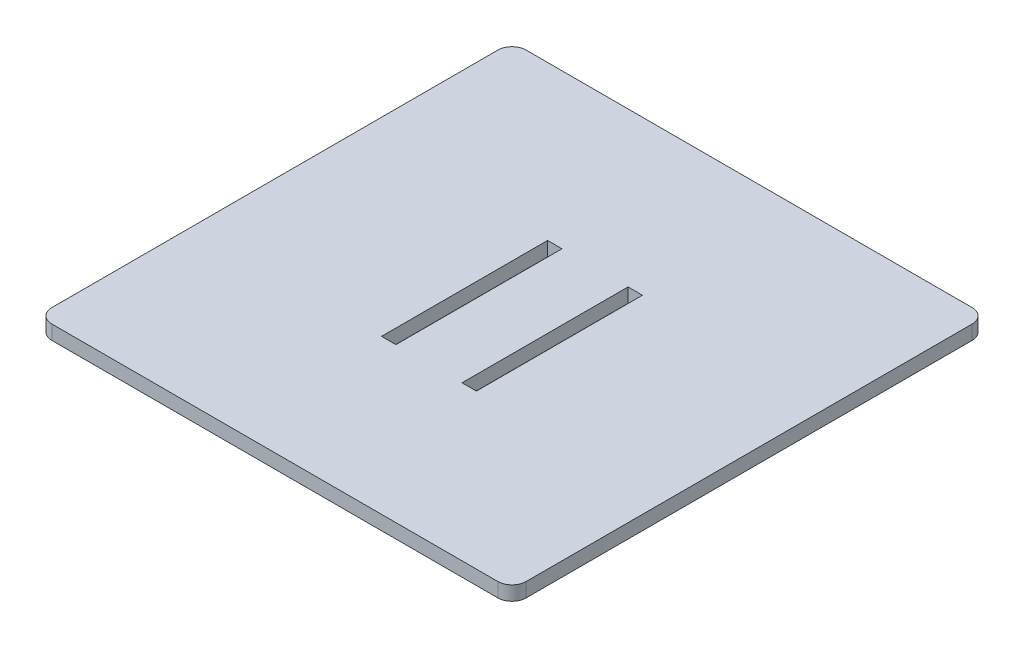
ISO-10303-21;
HEADER;
FILE_DESCRIPTION(('STEP AP214'),'2;1');
FILE_NAME('part.step','',(''),(''),'','','');
FILE_SCHEMA(('AUTOMOTIVE_DESIGN { 1 0 10303 214 1 1 1 1 }'));
ENDSEC;
DATA;
#1=APPLICATION_CONTEXT('core data for automotive mechanical design processes');
#2=APPLICATION_PROTOCOL_DEFINITION('international standard','automotive_design',2000,#1);
#3=PRODUCT_CONTEXT('',#1,'mechanical');
#4=PRODUCT('Part','Part','',(#3));
#5=PRODUCT_RELATED_PRODUCT_CATEGORY('part','',(#4));
#6=PRODUCT_DEFINITION_FORMATION('','',#4);
#7=PRODUCT_DEFINITION_CONTEXT('part definition',#1,'design');
#8=PRODUCT_DEFINITION('design','',#6,#7);
#9=PRODUCT_DEFINITION_SHAPE('','',#8);
#10=(LENGTH_UNIT() NAMED_UNIT(*) SI_UNIT(.MILLI.,.METRE.));
#11=(NAMED_UNIT(*) PLANE_ANGLE_UNIT() SI_UNIT($,.RADIAN.));
#12=(NAMED_UNIT(*) SI_UNIT($,.STERADIAN.) SOLID_ANGLE_UNIT());
#13=UNCERTAINTY_MEASURE_WITH_UNIT(LENGTH_MEASURE(1.E-05),#10,'distance_accuracy_value','');
#14=(GEOMETRIC_REPRESENTATION_CONTEXT(3) GLOBAL_UNCERTAINTY_ASSIGNED_CONTEXT((#13)) GLOBAL_UNIT_ASSIGNED_CONTEXT((#10,
#11,#12)) REPRESENTATION_CONTEXT('',''));
#15=CARTESIAN_POINT('',(0.,0.,0.));
#16=DIRECTION('',(0.,0.,1.));
#17=DIRECTION('',(1.,0.,0.));
#18=AXIS2_PLACEMENT_3D('',#15,#16,#17);
#19=CARTESIAN_POINT('',(0.,6.,0.));
#20=DIRECTION('',(0.,1.,0.));
#21=DIRECTION('',(0.,0.,1.));
#22=AXIS2_PLACEMENT_3D('',#19,#20,#21);
#23=PLANE('',#22);
#24=DIRECTION('',(0.,0.,-1.));
#25=VECTOR('',#24,1.);
#26=CARTESIAN_POINT('',(100.,6.,-100.));
#27=LINE('',#26,#25);
#28=CARTESIAN_POINT('',(100.,6.,94.));
#29=VERTEX_POINT('',#28);
#30=CARTESIAN_POINT('',(100.,6.,-94.));
#31=VERTEX_POINT('',#30);
#32=EDGE_CURVE('E259',#29,#31,#27,.T.);
#33=ORIENTED_EDGE('',*,*,#32,.T.);
#34=CARTESIAN_POINT('',(94.,6.,-94.));
#35=DIRECTION('',(0.,1.,0.));
#36=DIRECTION('',(0.,0.,1.));
#37=AXIS2_PLACEMENT_3D('',#34,#35,#36);
#38=CIRCLE('',#37,6.);
#39=CARTESIAN_POINT('',(94.,6.,-100.));
#40=VERTEX_POINT('',#39);
#41=EDGE_CURVE('E321',#31,#40,#38,.T.);
#42=ORIENTED_EDGE('',*,*,#41,.T.);
#43=DIRECTION('',(-1.,0.,0.));
#44=VECTOR('',#43,1.);
#45=CARTESIAN_POINT('',(-100.,6.,-100.));
#46=LINE('',#45,#44);
#47=CARTESIAN_POINT('',(-94.,6.,-100.));
#48=VERTEX_POINT('',#47);
#49=EDGE_CURVE('E263',#40,#48,#46,.T.);
#50=ORIENTED_EDGE('',*,*,#49,.T.);
#51=CARTESIAN_POINT('',(-94.,6.,-94.));
#52=DIRECTION('',(0.,1.,0.));
#53=DIRECTION('',(0.,0.,1.));
#54=AXIS2_PLACEMENT_3D('',#51,#52,#53);
#55=CIRCLE('',#54,6.);
#56=CARTESIAN_POINT('',(-100.,6.,-94.));
#57=VERTEX_POINT('',#56);
#58=EDGE_CURVE('E318',#48,#57,#55,.T.);
#59=ORIENTED_EDGE('',*,*,#58,.T.);
#60=DIRECTION('',(0.,0.,1.));
#61=VECTOR('',#60,1.);
#62=CARTESIAN_POINT('',(-100.,6.,-100.));
#63=LINE('',#62,#61);
#64=CARTESIAN_POINT('',(-100.,6.,94.));
#65=VERTEX_POINT('',#64);
#66=EDGE_CURVE('E268',#57,#65,#63,.T.);
#67=ORIENTED_EDGE('',*,*,#66,.T.);
#68=CARTESIAN_POINT('',(-94.,6.,94.));
#69=DIRECTION('',(0.,1.,0.));
#70=DIRECTION('',(0.,0.,1.));
#71=AXIS2_PLACEMENT_3D('',#68,#69,#70);
#72=CIRCLE('',#71,6.);
#73=CARTESIAN_POINT('',(-94.,6.,100.));
#74=VERTEX_POINT('',#73);
#75=EDGE_CURVE('E69',#65,#74,#72,.T.);
#76=ORIENTED_EDGE('',*,*,#75,.T.);
#77=DIRECTION('',(1.,0.,0.));
#78=VECTOR('',#77,1.);
#79=CARTESIAN_POINT('',(-100.,6.,100.));
#80=LINE('',#79,#78);
#81=CARTESIAN_POINT('',(94.,6.,100.));
#82=VERTEX_POINT('',#81);
#83=EDGE_CURVE('E271',#74,#82,#80,.T.);
#84=ORIENTED_EDGE('',*,*,#83,.T.);
#85=CARTESIAN_POINT('',(94.,6.,94.));
#86=DIRECTION('',(0.,1.,0.));
#87=DIRECTION('',(0.,0.,1.));
#88=AXIS2_PLACEMENT_3D('',#85,#86,#87);
#89=CIRCLE('',#88,6.);
#90=EDGE_CURVE('E313',#82,#29,#89,.T.);
#91=ORIENTED_EDGE('',*,*,#90,.T.);
#92=EDGE_LOOP('',(#33,#42,#50,#59,#67,#76,#84,#91));
#93=FACE_BOUND('',#92,.T.);
#94=DIRECTION('',(1.,0.,0.));
#95=VECTOR('',#94,1.);
#96=CARTESIAN_POINT('',(-20.,6.,35.));
#97=LINE('',#96,#95);
#98=CARTESIAN_POINT('',(-20.,6.,35.));
#99=VERTEX_POINT('',#98);
#100=CARTESIAN_POINT('',(-13.93,6.,35.));
#101=VERTEX_POINT('',#100);
#102=EDGE_CURVE('E219',#99,#101,#97,.T.);
#103=ORIENTED_EDGE('',*,*,#102,.F.);
#104=DIRECTION('',(0.,0.,1.));
#105=VECTOR('',#104,1.);
#106=CARTESIAN_POINT('',(-20.,6.,-35.));
#107=LINE('',#106,#105);
#108=CARTESIAN_POINT('',(-20.,6.,-35.));
#109=VERTEX_POINT('',#108);
#110=EDGE_CURVE('E216',#109,#99,#107,.T.);
#111=ORIENTED_EDGE('',*,*,#110,.F.);
#112=DIRECTION('',(-1.,0.,0.));
#113=VECTOR('',#112,1.);
#114=CARTESIAN_POINT('',(-20.,6.,-35.));
#115=LINE('',#114,#113);
#116=CARTESIAN_POINT('',(-13.93,6.,-35.));
#117=VERTEX_POINT('',#116);
#118=EDGE_CURVE('E227',#117,#109,#115,.T.);
#119=ORIENTED_EDGE('',*,*,#118,.F.);
#120=DIRECTION('',(0.,0.,-1.));
#121=VECTOR('',#120,1.);
#122=CARTESIAN_POINT('',(-13.93,6.,-35.));
#123=LINE('',#122,#121);
#124=EDGE_CURVE('E223',#101,#117,#123,.T.);
#125=ORIENTED_EDGE('',*,*,#124,.F.);
#126=EDGE_LOOP('',(#103,#111,#119,#125));
#127=FACE_BOUND('',#126,.T.);
#128=DIRECTION('',(-1.,0.,0.));
#129=VECTOR('',#128,1.);
#130=CARTESIAN_POINT('',(20.,6.,-34.9999999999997));
#131=LINE('',#130,#129);
#132=CARTESIAN_POINT('',(20.,6.,-34.9999999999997));
#133=VERTEX_POINT('',#132);
#134=CARTESIAN_POINT('',(13.93,6.,-34.9999999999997));
#135=VERTEX_POINT('',#134);
#136=EDGE_CURVE('E174',#133,#135,#131,.T.);
#137=ORIENTED_EDGE('',*,*,#136,.F.);
#138=DIRECTION('',(0.,0.,-1.));
#139=VECTOR('',#138,1.);
#140=CARTESIAN_POINT('',(20.,6.,35.));
#141=LINE('',#140,#139);
#142=CARTESIAN_POINT('',(20.,6.,35.));
#143=VERTEX_POINT('',#142);
#144=EDGE_CURVE('E163',#143,#133,#141,.T.);
#145=ORIENTED_EDGE('',*,*,#144,.F.);
#146=DIRECTION('',(1.,0.,0.));
#147=VECTOR('',#146,1.);
#148=CARTESIAN_POINT('',(20.,6.,35.));
#149=LINE('',#148,#147);
#150=CARTESIAN_POINT('',(13.93,6.,35.));
#151=VERTEX_POINT('',#150);
#152=EDGE_CURVE('E192',#151,#143,#149,.T.);
#153=ORIENTED_EDGE('',*,*,#152,.F.);
#154=DIRECTION('',(0.,0.,1.));
#155=VECTOR('',#154,1.);
#156=CARTESIAN_POINT('',(13.93,6.,35.));
#157=LINE('',#156,#155);
#158=EDGE_CURVE('E188',#135,#151,#157,.T.);
#159=ORIENTED_EDGE('',*,*,#158,.F.);
#160=EDGE_LOOP('',(#137,#145,#153,#159));
#161=FACE_BOUND('',#160,.T.);
#162=ADVANCED_FACE('F47',(#93,#127,#161),#23,.T.);
#163=CARTESIAN_POINT('',(0.,0.,0.));
#164=DIRECTION('',(0.,1.,0.));
#165=DIRECTION('',(0.,0.,1.));
#166=AXIS2_PLACEMENT_3D('',#163,#164,#165);
#167=PLANE('',#166);
#168=DIRECTION('',(0.,0.,1.));
#169=VECTOR('',#168,1.);
#170=CARTESIAN_POINT('',(-20.,0.,-35.));
#171=LINE('',#170,#169);
#172=CARTESIAN_POINT('',(-20.,0.,-35.));
#173=VERTEX_POINT('',#172);
#174=CARTESIAN_POINT('',(-20.,0.,35.));
#175=VERTEX_POINT('',#174);
#176=EDGE_CURVE('E183',#173,#175,#171,.T.);
#177=ORIENTED_EDGE('',*,*,#176,.T.);
#178=DIRECTION('',(1.,0.,0.));
#179=VECTOR('',#178,1.);
#180=CARTESIAN_POINT('',(-20.,0.,35.));
#181=LINE('',#180,#179);
#182=CARTESIAN_POINT('',(-13.93,0.,35.));
#183=VERTEX_POINT('',#182);
#184=EDGE_CURVE('E234',#175,#183,#181,.T.);
#185=ORIENTED_EDGE('',*,*,#184,.T.);
#186=DIRECTION('',(0.,0.,-1.));
#187=VECTOR('',#186,1.);
#188=CARTESIAN_POINT('',(-13.93,0.,-35.));
#189=LINE('',#188,#187);
#190=CARTESIAN_POINT('',(-13.93,0.,-35.));
#191=VERTEX_POINT('',#190);
#192=EDGE_CURVE('E238',#183,#191,#189,.T.);
#193=ORIENTED_EDGE('',*,*,#192,.T.);
#194=DIRECTION('',(-1.,0.,0.));
#195=VECTOR('',#194,1.);
#196=CARTESIAN_POINT('',(-20.,0.,-35.));
#197=LINE('',#196,#195);
#198=EDGE_CURVE('E220',#191,#173,#197,.T.);
#199=ORIENTED_EDGE('',*,*,#198,.T.);
#200=EDGE_LOOP('',(#177,#185,#193,#199));
#201=FACE_BOUND('',#200,.T.);
#202=DIRECTION('',(-1.,0.,0.));
#203=VECTOR('',#202,1.);
#204=CARTESIAN_POINT('',(-100.,0.,-100.));
#205=LINE('',#204,#203);
#206=CARTESIAN_POINT('',(94.,0.,-100.));
#207=VERTEX_POINT('',#206);
#208=CARTESIAN_POINT('',(-94.,0.,-100.));
#209=VERTEX_POINT('',#208);
#210=EDGE_CURVE('E278',#207,#209,#205,.T.);
#211=ORIENTED_EDGE('',*,*,#210,.F.);
#212=CARTESIAN_POINT('',(94.,0.,-94.));
#213=DIRECTION('',(0.,1.,0.));
#214=DIRECTION('',(0.,0.,1.));
#215=AXIS2_PLACEMENT_3D('',#212,#213,#214);
#216=CIRCLE('',#215,6.);
#217=CARTESIAN_POINT('',(100.,0.,-94.));
#218=VERTEX_POINT('',#217);
#219=EDGE_CURVE('E303',#207,#218,#216,.F.);
#220=ORIENTED_EDGE('',*,*,#219,.T.);
#221=DIRECTION('',(0.,0.,-1.));
#222=VECTOR('',#221,1.);
#223=CARTESIAN_POINT('',(100.,0.,-100.));
#224=LINE('',#223,#222);
#225=CARTESIAN_POINT('',(100.,0.,94.));
#226=VERTEX_POINT('',#225);
#227=EDGE_CURVE('E258',#226,#218,#224,.T.);
#228=ORIENTED_EDGE('',*,*,#227,.F.);
#229=CARTESIAN_POINT('',(94.,0.,94.));
#230=DIRECTION('',(0.,1.,0.));
#231=DIRECTION('',(0.,0.,1.));
#232=AXIS2_PLACEMENT_3D('',#229,#230,#231);
#233=CIRCLE('',#232,6.);
#234=CARTESIAN_POINT('',(94.,0.,100.));
#235=VERTEX_POINT('',#234);
#236=EDGE_CURVE('E294',#226,#235,#233,.F.);
#237=ORIENTED_EDGE('',*,*,#236,.T.);
#238=DIRECTION('',(1.,0.,0.));
#239=VECTOR('',#238,1.);
#240=CARTESIAN_POINT('',(-100.,0.,100.));
#241=LINE('',#240,#239);
#242=CARTESIAN_POINT('',(-94.,0.,100.));
#243=VERTEX_POINT('',#242);
#244=EDGE_CURVE('E264',#243,#235,#241,.T.);
#245=ORIENTED_EDGE('',*,*,#244,.F.);
#246=CARTESIAN_POINT('',(-94.,0.,94.));
#247=DIRECTION('',(0.,1.,0.));
#248=DIRECTION('',(0.,0.,1.));
#249=AXIS2_PLACEMENT_3D('',#246,#247,#248);
#250=CIRCLE('',#249,6.);
#251=CARTESIAN_POINT('',(-100.,0.,94.));
#252=VERTEX_POINT('',#251);
#253=EDGE_CURVE('E297',#243,#252,#250,.F.);
#254=ORIENTED_EDGE('',*,*,#253,.T.);
#255=DIRECTION('',(0.,0.,1.));
#256=VECTOR('',#255,1.);
#257=CARTESIAN_POINT('',(-100.,0.,-100.));
#258=LINE('',#257,#256);
#259=CARTESIAN_POINT('',(-100.,0.,-94.));
#260=VERTEX_POINT('',#259);
#261=EDGE_CURVE('E282',#260,#252,#258,.T.);
#262=ORIENTED_EDGE('',*,*,#261,.F.);
#263=CARTESIAN_POINT('',(-94.,0.,-94.));
#264=DIRECTION('',(0.,1.,0.));
#265=DIRECTION('',(0.,0.,1.));
#266=AXIS2_PLACEMENT_3D('',#263,#264,#265);
#267=CIRCLE('',#266,6.);
#268=EDGE_CURVE('E300',#260,#209,#267,.F.);
#269=ORIENTED_EDGE('',*,*,#268,.T.);
#270=EDGE_LOOP('',(#211,#220,#228,#237,#245,#254,#262,#269));
#271=FACE_BOUND('',#270,.T.);
#272=DIRECTION('',(0.,0.,-1.));
#273=VECTOR('',#272,1.);
#274=CARTESIAN_POINT('',(20.,0.,35.));
#275=LINE('',#274,#273);
#276=CARTESIAN_POINT('',(20.,0.,35.));
#277=VERTEX_POINT('',#276);
#278=CARTESIAN_POINT('',(20.,0.,-34.9999999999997));
#279=VERTEX_POINT('',#278);
#280=EDGE_CURVE('E197',#277,#279,#275,.T.);
#281=ORIENTED_EDGE('',*,*,#280,.T.);
#282=DIRECTION('',(-1.,0.,0.));
#283=VECTOR('',#282,1.);
#284=CARTESIAN_POINT('',(20.,0.,-34.9999999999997));
#285=LINE('',#284,#283);
#286=CARTESIAN_POINT('',(13.93,0.,-34.9999999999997));
#287=VERTEX_POINT('',#286);
#288=EDGE_CURVE('E181',#279,#287,#285,.T.);
#289=ORIENTED_EDGE('',*,*,#288,.T.);
#290=DIRECTION('',(0.,0.,1.));
#291=VECTOR('',#290,1.);
#292=CARTESIAN_POINT('',(13.93,0.,35.));
#293=LINE('',#292,#291);
#294=CARTESIAN_POINT('',(13.93,0.,35.));
#295=VERTEX_POINT('',#294);
#296=EDGE_CURVE('E202',#287,#295,#293,.T.);
#297=ORIENTED_EDGE('',*,*,#296,.T.);
#298=DIRECTION('',(1.,0.,0.));
#299=VECTOR('',#298,1.);
#300=CARTESIAN_POINT('',(20.,0.,35.));
#301=LINE('',#300,#299);
#302=EDGE_CURVE('E175',#295,#277,#301,.T.);
#303=ORIENTED_EDGE('',*,*,#302,.T.);
#304=EDGE_LOOP('',(#281,#289,#297,#303));
#305=FACE_BOUND('',#304,.T.);
#306=ADVANCED_FACE('F341',(#201,#271,#305),#167,.F.);
#307=CARTESIAN_POINT('',(100.,6.,-100.));
#308=DIRECTION('',(-1.,0.,0.));
#309=DIRECTION('',(0.,0.,1.));
#310=AXIS2_PLACEMENT_3D('',#307,#308,#309);
#311=PLANE('',#310);
#312=ORIENTED_EDGE('',*,*,#227,.T.);
#313=DIRECTION('',(0.,-1.,0.));
#314=VECTOR('',#313,1.);
#315=CARTESIAN_POINT('',(100.,6.,-94.));
#316=LINE('',#315,#314);
#317=EDGE_CURVE('E310',#218,#31,#316,.F.);
#318=ORIENTED_EDGE('',*,*,#317,.T.);
#319=ORIENTED_EDGE('',*,*,#32,.F.);
#320=DIRECTION('',(0.,-1.,0.));
#321=VECTOR('',#320,1.);
#322=CARTESIAN_POINT('',(100.,6.,94.));
#323=LINE('',#322,#321);
#324=EDGE_CURVE('E306',#29,#226,#323,.T.);
#325=ORIENTED_EDGE('',*,*,#324,.T.);
#326=EDGE_LOOP('',(#312,#318,#319,#325));
#327=FACE_BOUND('',#326,.T.);
#328=ADVANCED_FACE('F355',(#327),#311,.F.);
#329=CARTESIAN_POINT('',(-100.,6.,-100.));
#330=DIRECTION('',(0.,0.,1.));
#331=DIRECTION('',(1.,0.,0.));
#332=AXIS2_PLACEMENT_3D('',#329,#330,#331);
#333=PLANE('',#332);
#334=ORIENTED_EDGE('',*,*,#49,.F.);
#335=DIRECTION('',(0.,-1.,0.));
#336=VECTOR('',#335,1.);
#337=CARTESIAN_POINT('',(94.,6.,-100.));
#338=LINE('',#337,#336);
#339=EDGE_CURVE('E290',#40,#207,#338,.T.);
#340=ORIENTED_EDGE('',*,*,#339,.T.);
#341=ORIENTED_EDGE('',*,*,#210,.T.);
#342=DIRECTION('',(0.,-1.,0.));
#343=VECTOR('',#342,1.);
#344=CARTESIAN_POINT('',(-94.,6.,-100.));
#345=LINE('',#344,#343);
#346=EDGE_CURVE('E274',#209,#48,#345,.F.);
#347=ORIENTED_EDGE('',*,*,#346,.T.);
#348=EDGE_LOOP('',(#334,#340,#341,#347));
#349=FACE_BOUND('',#348,.T.);
#350=ADVANCED_FACE('F363',(#349),#333,.F.);
#351=CARTESIAN_POINT('',(-100.,6.,-100.));
#352=DIRECTION('',(1.,0.,0.));
#353=DIRECTION('',(0.,0.,-1.));
#354=AXIS2_PLACEMENT_3D('',#351,#352,#353);
#355=PLANE('',#354);
#356=ORIENTED_EDGE('',*,*,#66,.F.);
#357=DIRECTION('',(0.,-1.,0.));
#358=VECTOR('',#357,1.);
#359=CARTESIAN_POINT('',(-100.,6.,-94.));
#360=LINE('',#359,#358);
#361=EDGE_CURVE('E327',#57,#260,#360,.T.);
#362=ORIENTED_EDGE('',*,*,#361,.T.);
#363=ORIENTED_EDGE('',*,*,#261,.T.);
#364=DIRECTION('',(0.,-1.,0.));
#365=VECTOR('',#364,1.);
#366=CARTESIAN_POINT('',(-100.,6.,94.));
#367=LINE('',#366,#365);
#368=EDGE_CURVE('E324',#252,#65,#367,.F.);
#369=ORIENTED_EDGE('',*,*,#368,.T.);
#370=EDGE_LOOP('',(#356,#362,#363,#369));
#371=FACE_BOUND('',#370,.T.);
#372=ADVANCED_FACE('F335',(#371),#355,.F.);
#373=CARTESIAN_POINT('',(-100.,6.,100.));
#374=DIRECTION('',(0.,0.,-1.));
#375=DIRECTION('',(-1.,0.,0.));
#376=AXIS2_PLACEMENT_3D('',#373,#374,#375);
#377=PLANE('',#376);
#378=ORIENTED_EDGE('',*,*,#83,.F.);
#379=DIRECTION('',(0.,-1.,0.));
#380=VECTOR('',#379,1.);
#381=CARTESIAN_POINT('',(-94.,6.,100.));
#382=LINE('',#381,#380);
#383=EDGE_CURVE('E11',#74,#243,#382,.T.);
#384=ORIENTED_EDGE('',*,*,#383,.T.);
#385=ORIENTED_EDGE('',*,*,#244,.T.);
#386=DIRECTION('',(0.,-1.,0.));
#387=VECTOR('',#386,1.);
#388=CARTESIAN_POINT('',(94.,6.,100.));
#389=LINE('',#388,#387);
#390=EDGE_CURVE('E56',#235,#82,#389,.F.);
#391=ORIENTED_EDGE('',*,*,#390,.T.);
#392=EDGE_LOOP('',(#378,#384,#385,#391));
#393=FACE_BOUND('',#392,.T.);
#394=ADVANCED_FACE('F347',(#393),#377,.F.);
#395=CARTESIAN_POINT('',(-20.,6.,-35.));
#396=DIRECTION('',(1.,0.,0.));
#397=DIRECTION('',(0.,0.,-1.));
#398=AXIS2_PLACEMENT_3D('',#395,#396,#397);
#399=PLANE('',#398);
#400=ORIENTED_EDGE('',*,*,#176,.F.);
#401=DIRECTION('',(0.,-1.,0.));
#402=VECTOR('',#401,1.);
#403=CARTESIAN_POINT('',(-20.,6.,-35.));
#404=LINE('',#403,#402);
#405=EDGE_CURVE('E230',#109,#173,#404,.T.);
#406=ORIENTED_EDGE('',*,*,#405,.F.);
#407=ORIENTED_EDGE('',*,*,#110,.T.);
#408=DIRECTION('',(0.,-1.,0.));
#409=VECTOR('',#408,1.);
#410=CARTESIAN_POINT('',(-20.,6.,35.));
#411=LINE('',#410,#409);
#412=EDGE_CURVE('E254',#99,#175,#411,.T.);
#413=ORIENTED_EDGE('',*,*,#412,.T.);
#414=EDGE_LOOP('',(#400,#406,#407,#413));
#415=FACE_BOUND('',#414,.T.);
#416=ADVANCED_FACE('F381',(#415),#399,.T.);
#417=CARTESIAN_POINT('',(-20.,6.,35.));
#418=DIRECTION('',(0.,0.,-1.));
#419=DIRECTION('',(-1.,0.,0.));
#420=AXIS2_PLACEMENT_3D('',#417,#418,#419);
#421=PLANE('',#420);
#422=ORIENTED_EDGE('',*,*,#184,.F.);
#423=ORIENTED_EDGE('',*,*,#412,.F.);
#424=ORIENTED_EDGE('',*,*,#102,.T.);
#425=DIRECTION('',(0.,-1.,0.));
#426=VECTOR('',#425,1.);
#427=CARTESIAN_POINT('',(-13.93,6.,35.));
#428=LINE('',#427,#426);
#429=EDGE_CURVE('E251',#101,#183,#428,.T.);
#430=ORIENTED_EDGE('',*,*,#429,.T.);
#431=EDGE_LOOP('',(#422,#423,#424,#430));
#432=FACE_BOUND('',#431,.T.);
#433=ADVANCED_FACE('F458',(#432),#421,.T.);
#434=CARTESIAN_POINT('',(-13.93,6.,-35.));
#435=DIRECTION('',(-1.,0.,0.));
#436=DIRECTION('',(0.,0.,1.));
#437=AXIS2_PLACEMENT_3D('',#434,#435,#436);
#438=PLANE('',#437);
#439=ORIENTED_EDGE('',*,*,#192,.F.);
#440=ORIENTED_EDGE('',*,*,#429,.F.);
#441=ORIENTED_EDGE('',*,*,#124,.T.);
#442=DIRECTION('',(0.,-1.,0.));
#443=VECTOR('',#442,1.);
#444=CARTESIAN_POINT('',(-13.93,6.,-35.));
#445=LINE('',#444,#443);
#446=EDGE_CURVE('E248',#117,#191,#445,.T.);
#447=ORIENTED_EDGE('',*,*,#446,.T.);
#448=EDGE_LOOP('',(#439,#440,#441,#447));
#449=FACE_BOUND('',#448,.T.);
#450=ADVANCED_FACE('F448',(#449),#438,.T.);
#451=CARTESIAN_POINT('',(-20.,6.,-35.));
#452=DIRECTION('',(0.,0.,1.));
#453=DIRECTION('',(1.,0.,0.));
#454=AXIS2_PLACEMENT_3D('',#451,#452,#453);
#455=PLANE('',#454);
#456=ORIENTED_EDGE('',*,*,#198,.F.);
#457=ORIENTED_EDGE('',*,*,#446,.F.);
#458=ORIENTED_EDGE('',*,*,#118,.T.);
#459=ORIENTED_EDGE('',*,*,#405,.T.);
#460=EDGE_LOOP('',(#456,#457,#458,#459));
#461=FACE_BOUND('',#460,.T.);
#462=ADVANCED_FACE('F439',(#461),#455,.T.);
#463=CARTESIAN_POINT('',(20.,6.,35.));
#464=DIRECTION('',(-1.,0.,0.));
#465=DIRECTION('',(0.,0.,1.));
#466=AXIS2_PLACEMENT_3D('',#463,#464,#465);
#467=PLANE('',#466);
#468=ORIENTED_EDGE('',*,*,#280,.F.);
#469=DIRECTION('',(0.,-1.,0.));
#470=VECTOR('',#469,1.);
#471=CARTESIAN_POINT('',(20.,6.,35.));
#472=LINE('',#471,#470);
#473=EDGE_CURVE('E169',#143,#277,#472,.T.);
#474=ORIENTED_EDGE('',*,*,#473,.F.);
#475=ORIENTED_EDGE('',*,*,#144,.T.);
#476=DIRECTION('',(0.,-1.,0.));
#477=VECTOR('',#476,1.);
#478=CARTESIAN_POINT('',(20.,6.,-34.9999999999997));
#479=LINE('',#478,#477);
#480=EDGE_CURVE('E166',#133,#279,#479,.T.);
#481=ORIENTED_EDGE('',*,*,#480,.T.);
#482=EDGE_LOOP('',(#468,#474,#475,#481));
#483=FACE_BOUND('',#482,.T.);
#484=ADVANCED_FACE('F165',(#483),#467,.T.);
#485=CARTESIAN_POINT('',(20.,6.,-34.9999999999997));
#486=DIRECTION('',(0.,0.,1.));
#487=DIRECTION('',(1.,0.,0.));
#488=AXIS2_PLACEMENT_3D('',#485,#486,#487);
#489=PLANE('',#488);
#490=ORIENTED_EDGE('',*,*,#288,.F.);
#491=ORIENTED_EDGE('',*,*,#480,.F.);
#492=ORIENTED_EDGE('',*,*,#136,.T.);
#493=DIRECTION('',(0.,-1.,0.));
#494=VECTOR('',#493,1.);
#495=CARTESIAN_POINT('',(13.93,6.,-34.9999999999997));
#496=LINE('',#495,#494);
#497=EDGE_CURVE('E184',#135,#287,#496,.T.);
#498=ORIENTED_EDGE('',*,*,#497,.T.);
#499=EDGE_LOOP('',(#490,#491,#492,#498));
#500=FACE_BOUND('',#499,.T.);
#501=ADVANCED_FACE('F178',(#500),#489,.T.);
#502=CARTESIAN_POINT('',(13.93,6.,35.));
#503=DIRECTION('',(1.,0.,0.));
#504=DIRECTION('',(0.,0.,-1.));
#505=AXIS2_PLACEMENT_3D('',#502,#503,#504);
#506=PLANE('',#505);
#507=ORIENTED_EDGE('',*,*,#296,.F.);
#508=ORIENTED_EDGE('',*,*,#497,.F.);
#509=ORIENTED_EDGE('',*,*,#158,.T.);
#510=DIRECTION('',(0.,-1.,0.));
#511=VECTOR('',#510,1.);
#512=CARTESIAN_POINT('',(13.93,6.,35.));
#513=LINE('',#512,#511);
#514=EDGE_CURVE('E211',#151,#295,#513,.T.);
#515=ORIENTED_EDGE('',*,*,#514,.T.);
#516=EDGE_LOOP('',(#507,#508,#509,#515));
#517=FACE_BOUND('',#516,.T.);
#518=ADVANCED_FACE('F411',(#517),#506,.T.);
#519=CARTESIAN_POINT('',(20.,6.,35.));
#520=DIRECTION('',(0.,0.,-1.));
#521=DIRECTION('',(-1.,0.,0.));
#522=AXIS2_PLACEMENT_3D('',#519,#520,#521);
#523=PLANE('',#522);
#524=ORIENTED_EDGE('',*,*,#302,.F.);
#525=ORIENTED_EDGE('',*,*,#514,.F.);
#526=ORIENTED_EDGE('',*,*,#152,.T.);
#527=ORIENTED_EDGE('',*,*,#473,.T.);
#528=EDGE_LOOP('',(#524,#525,#526,#527));
#529=FACE_BOUND('',#528,.T.);
#530=ADVANCED_FACE('F372',(#529),#523,.T.);
#531=CARTESIAN_POINT('',(94.,6.,-94.));
#532=DIRECTION('',(0.,-1.,0.));
#533=DIRECTION('',(0.,0.,-1.));
#534=AXIS2_PLACEMENT_3D('',#531,#532,#533);
#535=CYLINDRICAL_SURFACE('',#534,6.);
#536=ORIENTED_EDGE('',*,*,#41,.F.);
#537=ORIENTED_EDGE('',*,*,#317,.F.);
#538=ORIENTED_EDGE('',*,*,#219,.F.);
#539=ORIENTED_EDGE('',*,*,#339,.F.);
#540=EDGE_LOOP('',(#536,#537,#538,#539));
#541=FACE_BOUND('',#540,.T.);
#542=ADVANCED_FACE('F360',(#541),#535,.T.);
#543=CARTESIAN_POINT('',(-94.,6.,-94.));
#544=DIRECTION('',(0.,-1.,0.));
#545=DIRECTION('',(0.,0.,-1.));
#546=AXIS2_PLACEMENT_3D('',#543,#544,#545);
#547=CYLINDRICAL_SURFACE('',#546,6.);
#548=ORIENTED_EDGE('',*,*,#58,.F.);
#549=ORIENTED_EDGE('',*,*,#346,.F.);
#550=ORIENTED_EDGE('',*,*,#268,.F.);
#551=ORIENTED_EDGE('',*,*,#361,.F.);
#552=EDGE_LOOP('',(#548,#549,#550,#551));
#553=FACE_BOUND('',#552,.T.);
#554=ADVANCED_FACE('F365',(#553),#547,.T.);
#555=CARTESIAN_POINT('',(-94.,6.,94.));
#556=DIRECTION('',(0.,-1.,0.));
#557=DIRECTION('',(0.,0.,-1.));
#558=AXIS2_PLACEMENT_3D('',#555,#556,#557);
#559=CYLINDRICAL_SURFACE('',#558,6.);
#560=ORIENTED_EDGE('',*,*,#75,.F.);
#561=ORIENTED_EDGE('',*,*,#368,.F.);
#562=ORIENTED_EDGE('',*,*,#253,.F.);
#563=ORIENTED_EDGE('',*,*,#383,.F.);
#564=EDGE_LOOP('',(#560,#561,#562,#563));
#565=FACE_BOUND('',#564,.T.);
#566=ADVANCED_FACE('F346',(#565),#559,.T.);
#567=CARTESIAN_POINT('',(94.,6.,94.));
#568=DIRECTION('',(0.,-1.,0.));
#569=DIRECTION('',(0.,0.,-1.));
#570=AXIS2_PLACEMENT_3D('',#567,#568,#569);
#571=CYLINDRICAL_SURFACE('',#570,6.);
#572=ORIENTED_EDGE('',*,*,#90,.F.);
#573=ORIENTED_EDGE('',*,*,#390,.F.);
#574=ORIENTED_EDGE('',*,*,#236,.F.);
#575=ORIENTED_EDGE('',*,*,#324,.F.);
#576=EDGE_LOOP('',(#572,#573,#574,#575));
#577=FACE_BOUND('',#576,.T.);
#578=ADVANCED_FACE('F49',(#577),#571,.T.);
#579=CLOSED_SHELL('',(#162,#306,#328,#350,#372,#394,#416,#433,#450,#462,#484,#501,#518,#530,
#542,#554,#566,#578));
#580=MANIFOLD_SOLID_BREP('B2',#579);
#581=ADVANCED_BREP_SHAPE_REPRESENTATION('',(#18,#580),#14);
#582=SHAPE_DEFINITION_REPRESENTATION(#9,#581);
ENDSEC;
END-ISO-10303-21;
